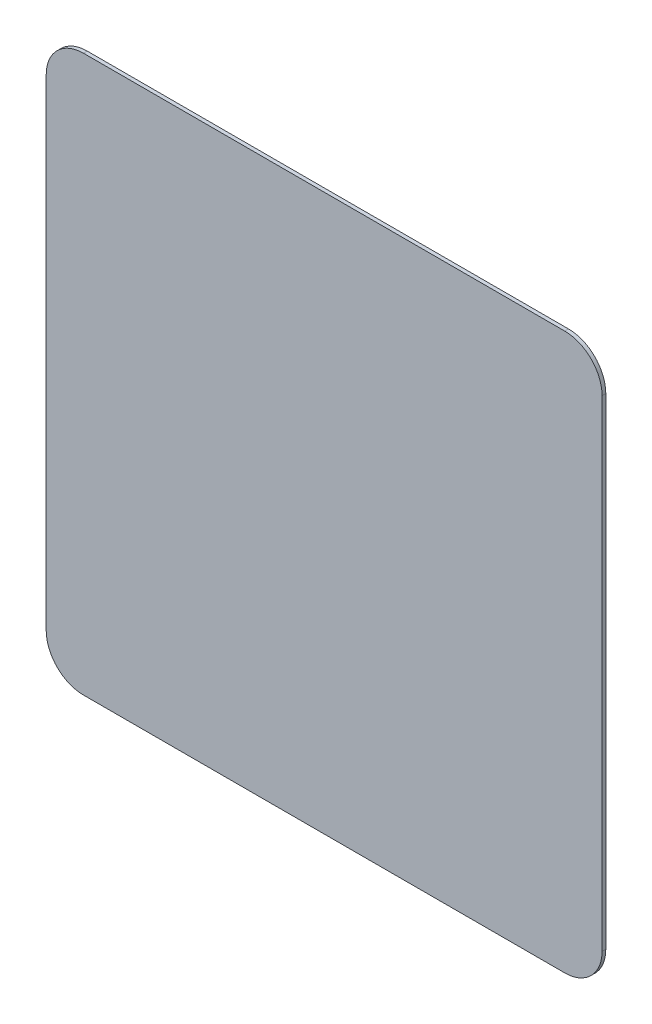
ISO-10303-21;
HEADER;
FILE_DESCRIPTION(('STEP AP214'),'2;1');
FILE_NAME('part.step','',(''),(''),'','','');
FILE_SCHEMA(('AUTOMOTIVE_DESIGN { 1 0 10303 214 1 1 1 1 }'));
ENDSEC;
DATA;
#1=APPLICATION_CONTEXT('core data for automotive mechanical design processes');
#2=APPLICATION_PROTOCOL_DEFINITION('international standard','automotive_design',2000,#1);
#3=PRODUCT_CONTEXT('',#1,'mechanical');
#4=PRODUCT('Part','Part','',(#3));
#5=PRODUCT_RELATED_PRODUCT_CATEGORY('part','',(#4));
#6=PRODUCT_DEFINITION_FORMATION('','',#4);
#7=PRODUCT_DEFINITION_CONTEXT('part definition',#1,'design');
#8=PRODUCT_DEFINITION('design','',#6,#7);
#9=PRODUCT_DEFINITION_SHAPE('','',#8);
#10=(LENGTH_UNIT() NAMED_UNIT(*) SI_UNIT(.MILLI.,.METRE.));
#11=(NAMED_UNIT(*) PLANE_ANGLE_UNIT() SI_UNIT($,.RADIAN.));
#12=(NAMED_UNIT(*) SI_UNIT($,.STERADIAN.) SOLID_ANGLE_UNIT());
#13=UNCERTAINTY_MEASURE_WITH_UNIT(LENGTH_MEASURE(1.E-05),#10,'distance_accuracy_value','');
#14=(GEOMETRIC_REPRESENTATION_CONTEXT(3) GLOBAL_UNCERTAINTY_ASSIGNED_CONTEXT((#13)) GLOBAL_UNIT_ASSIGNED_CONTEXT((#10,
#11,#12)) REPRESENTATION_CONTEXT('',''));
#15=CARTESIAN_POINT('',(0.,0.,0.));
#16=DIRECTION('',(0.,0.,1.));
#17=DIRECTION('',(1.,0.,0.));
#18=AXIS2_PLACEMENT_3D('',#15,#16,#17);
#19=CARTESIAN_POINT('',(-32.9325153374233,15.3061349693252,0.4));
#20=DIRECTION('',(0.,0.,-1.));
#21=DIRECTION('',(-1.,0.,0.));
#22=AXIS2_PLACEMENT_3D('',#19,#20,#21);
#23=CYLINDRICAL_SURFACE('',#22,4.);
#24=CARTESIAN_POINT('',(-32.9325153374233,15.3061349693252,0.));
#25=DIRECTION('',(0.,0.,1.));
#26=DIRECTION('',(-1.,0.,0.));
#27=AXIS2_PLACEMENT_3D('',#24,#25,#26);
#28=CIRCLE('',#27,4.);
#29=CARTESIAN_POINT('',(-32.9325153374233,19.3061349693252,0.));
#30=VERTEX_POINT('',#29);
#31=CARTESIAN_POINT('',(-36.9325153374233,15.3061349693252,0.));
#32=VERTEX_POINT('',#31);
#33=EDGE_CURVE('E131',#30,#32,#28,.T.);
#34=ORIENTED_EDGE('',*,*,#33,.T.);
#35=DIRECTION('',(0.,0.,-1.));
#36=VECTOR('',#35,1.);
#37=CARTESIAN_POINT('',(-36.9325153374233,15.3061349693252,0.4));
#38=LINE('',#37,#36);
#39=CARTESIAN_POINT('',(-36.9325153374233,15.3061349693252,0.4));
#40=VERTEX_POINT('',#39);
#41=EDGE_CURVE('E11',#40,#32,#38,.T.);
#42=ORIENTED_EDGE('',*,*,#41,.F.);
#43=CARTESIAN_POINT('',(-32.9325153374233,15.3061349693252,0.4));
#44=DIRECTION('',(0.,0.,1.));
#45=DIRECTION('',(-1.,0.,0.));
#46=AXIS2_PLACEMENT_3D('',#43,#44,#45);
#47=CIRCLE('',#46,4.);
#48=CARTESIAN_POINT('',(-32.9325153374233,19.3061349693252,0.4));
#49=VERTEX_POINT('',#48);
#50=EDGE_CURVE('E145',#49,#40,#47,.T.);
#51=ORIENTED_EDGE('',*,*,#50,.F.);
#52=DIRECTION('',(0.,0.,-1.));
#53=VECTOR('',#52,1.);
#54=CARTESIAN_POINT('',(-32.9325153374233,19.3061349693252,0.4));
#55=LINE('',#54,#53);
#56=EDGE_CURVE('E127',#49,#30,#55,.T.);
#57=ORIENTED_EDGE('',*,*,#56,.T.);
#58=EDGE_LOOP('',(#34,#42,#51,#57));
#59=FACE_BOUND('',#58,.T.);
#60=ADVANCED_FACE('F35',(#59),#23,.T.);
#61=CARTESIAN_POINT('',(-36.9325153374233,15.3061349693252,0.4));
#62=DIRECTION('',(1.,0.,0.));
#63=DIRECTION('',(0.,1.,0.));
#64=AXIS2_PLACEMENT_3D('',#61,#62,#63);
#65=PLANE('',#64);
#66=DIRECTION('',(0.,-1.,0.));
#67=VECTOR('',#66,1.);
#68=CARTESIAN_POINT('',(-36.9325153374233,15.3061349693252,0.));
#69=LINE('',#68,#67);
#70=CARTESIAN_POINT('',(-36.9325153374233,-36.2938650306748,0.));
#71=VERTEX_POINT('',#70);
#72=EDGE_CURVE('E134',#32,#71,#69,.T.);
#73=ORIENTED_EDGE('',*,*,#72,.T.);
#74=DIRECTION('',(0.,0.,-1.));
#75=VECTOR('',#74,1.);
#76=CARTESIAN_POINT('',(-36.9325153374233,-36.2938650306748,0.4));
#77=LINE('',#76,#75);
#78=CARTESIAN_POINT('',(-36.9325153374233,-36.2938650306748,0.4));
#79=VERTEX_POINT('',#78);
#80=EDGE_CURVE('E43',#79,#71,#77,.T.);
#81=ORIENTED_EDGE('',*,*,#80,.F.);
#82=DIRECTION('',(0.,-1.,0.));
#83=VECTOR('',#82,1.);
#84=CARTESIAN_POINT('',(-36.9325153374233,15.3061349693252,0.4));
#85=LINE('',#84,#83);
#86=EDGE_CURVE('E94',#40,#79,#85,.T.);
#87=ORIENTED_EDGE('',*,*,#86,.F.);
#88=ORIENTED_EDGE('',*,*,#41,.T.);
#89=EDGE_LOOP('',(#73,#81,#87,#88));
#90=FACE_BOUND('',#89,.T.);
#91=ADVANCED_FACE('F180',(#90),#65,.F.);
#92=CARTESIAN_POINT('',(-32.9325153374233,-36.2938650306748,0.4));
#93=DIRECTION('',(0.,0.,-1.));
#94=DIRECTION('',(-1.,0.,0.));
#95=AXIS2_PLACEMENT_3D('',#92,#93,#94);
#96=CYLINDRICAL_SURFACE('',#95,4.);
#97=CARTESIAN_POINT('',(-32.9325153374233,-36.2938650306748,0.));
#98=DIRECTION('',(0.,0.,1.));
#99=DIRECTION('',(1.,0.,0.));
#100=AXIS2_PLACEMENT_3D('',#97,#98,#99);
#101=CIRCLE('',#100,4.);
#102=CARTESIAN_POINT('',(-32.9325153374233,-40.2938650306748,0.));
#103=VERTEX_POINT('',#102);
#104=EDGE_CURVE('E136',#71,#103,#101,.T.);
#105=ORIENTED_EDGE('',*,*,#104,.T.);
#106=DIRECTION('',(0.,0.,-1.));
#107=VECTOR('',#106,1.);
#108=CARTESIAN_POINT('',(-32.9325153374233,-40.2938650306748,0.4));
#109=LINE('',#108,#107);
#110=CARTESIAN_POINT('',(-32.9325153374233,-40.2938650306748,0.4));
#111=VERTEX_POINT('',#110);
#112=EDGE_CURVE('E152',#111,#103,#109,.T.);
#113=ORIENTED_EDGE('',*,*,#112,.F.);
#114=CARTESIAN_POINT('',(-32.9325153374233,-36.2938650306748,0.4));
#115=DIRECTION('',(0.,0.,1.));
#116=DIRECTION('',(1.,0.,0.));
#117=AXIS2_PLACEMENT_3D('',#114,#115,#116);
#118=CIRCLE('',#117,4.);
#119=EDGE_CURVE('E160',#79,#111,#118,.T.);
#120=ORIENTED_EDGE('',*,*,#119,.F.);
#121=ORIENTED_EDGE('',*,*,#80,.T.);
#122=EDGE_LOOP('',(#105,#113,#120,#121));
#123=FACE_BOUND('',#122,.T.);
#124=ADVANCED_FACE('F158',(#123),#96,.T.);
#125=CARTESIAN_POINT('',(-32.9325153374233,-40.2938650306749,0.4));
#126=DIRECTION('',(0.,1.,0.));
#127=DIRECTION('',(0.,0.,1.));
#128=AXIS2_PLACEMENT_3D('',#125,#126,#127);
#129=PLANE('',#128);
#130=DIRECTION('',(1.,0.,0.));
#131=VECTOR('',#130,1.);
#132=CARTESIAN_POINT('',(-32.9325153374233,-40.2938650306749,0.));
#133=LINE('',#132,#131);
#134=CARTESIAN_POINT('',(18.6674846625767,-40.2938650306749,0.));
#135=VERTEX_POINT('',#134);
#136=EDGE_CURVE('E138',#103,#135,#133,.T.);
#137=ORIENTED_EDGE('',*,*,#136,.T.);
#138=DIRECTION('',(0.,0.,-1.));
#139=VECTOR('',#138,1.);
#140=CARTESIAN_POINT('',(18.6674846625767,-40.2938650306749,0.4));
#141=LINE('',#140,#139);
#142=CARTESIAN_POINT('',(18.6674846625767,-40.2938650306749,0.4));
#143=VERTEX_POINT('',#142);
#144=EDGE_CURVE('E149',#143,#135,#141,.T.);
#145=ORIENTED_EDGE('',*,*,#144,.F.);
#146=DIRECTION('',(1.,0.,0.));
#147=VECTOR('',#146,1.);
#148=CARTESIAN_POINT('',(-32.9325153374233,-40.2938650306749,0.4));
#149=LINE('',#148,#147);
#150=EDGE_CURVE('E172',#111,#143,#149,.T.);
#151=ORIENTED_EDGE('',*,*,#150,.F.);
#152=ORIENTED_EDGE('',*,*,#112,.T.);
#153=EDGE_LOOP('',(#137,#145,#151,#152));
#154=FACE_BOUND('',#153,.T.);
#155=ADVANCED_FACE('F168',(#154),#129,.F.);
#156=CARTESIAN_POINT('',(18.6674846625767,-36.2938650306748,0.4));
#157=DIRECTION('',(0.,0.,-1.));
#158=DIRECTION('',(-1.,0.,0.));
#159=AXIS2_PLACEMENT_3D('',#156,#157,#158);
#160=CYLINDRICAL_SURFACE('',#159,4.);
#161=CARTESIAN_POINT('',(18.6674846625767,-36.2938650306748,0.));
#162=DIRECTION('',(0.,0.,1.));
#163=DIRECTION('',(1.,0.,0.));
#164=AXIS2_PLACEMENT_3D('',#161,#162,#163);
#165=CIRCLE('',#164,4.);
#166=CARTESIAN_POINT('',(22.6674846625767,-36.2938650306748,0.));
#167=VERTEX_POINT('',#166);
#168=EDGE_CURVE('E140',#135,#167,#165,.T.);
#169=ORIENTED_EDGE('',*,*,#168,.T.);
#170=DIRECTION('',(0.,0.,-1.));
#171=VECTOR('',#170,1.);
#172=CARTESIAN_POINT('',(22.6674846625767,-36.2938650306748,0.4));
#173=LINE('',#172,#171);
#174=CARTESIAN_POINT('',(22.6674846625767,-36.2938650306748,0.4));
#175=VERTEX_POINT('',#174);
#176=EDGE_CURVE('E122',#175,#167,#173,.T.);
#177=ORIENTED_EDGE('',*,*,#176,.F.);
#178=CARTESIAN_POINT('',(18.6674846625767,-36.2938650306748,0.4));
#179=DIRECTION('',(0.,0.,1.));
#180=DIRECTION('',(1.,0.,0.));
#181=AXIS2_PLACEMENT_3D('',#178,#179,#180);
#182=CIRCLE('',#181,4.);
#183=EDGE_CURVE('E113',#143,#175,#182,.T.);
#184=ORIENTED_EDGE('',*,*,#183,.F.);
#185=ORIENTED_EDGE('',*,*,#144,.T.);
#186=EDGE_LOOP('',(#169,#177,#184,#185));
#187=FACE_BOUND('',#186,.T.);
#188=ADVANCED_FACE('F171',(#187),#160,.T.);
#189=CARTESIAN_POINT('',(22.6674846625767,15.3061349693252,0.4));
#190=DIRECTION('',(-1.,0.,0.));
#191=DIRECTION('',(0.,-1.,0.));
#192=AXIS2_PLACEMENT_3D('',#189,#190,#191);
#193=PLANE('',#192);
#194=DIRECTION('',(0.,1.,0.));
#195=VECTOR('',#194,1.);
#196=CARTESIAN_POINT('',(22.6674846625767,15.3061349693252,0.));
#197=LINE('',#196,#195);
#198=CARTESIAN_POINT('',(22.6674846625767,15.3061349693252,0.));
#199=VERTEX_POINT('',#198);
#200=EDGE_CURVE('E121',#167,#199,#197,.T.);
#201=ORIENTED_EDGE('',*,*,#200,.T.);
#202=DIRECTION('',(0.,0.,-1.));
#203=VECTOR('',#202,1.);
#204=CARTESIAN_POINT('',(22.6674846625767,15.3061349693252,0.4));
#205=LINE('',#204,#203);
#206=CARTESIAN_POINT('',(22.6674846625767,15.3061349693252,0.4));
#207=VERTEX_POINT('',#206);
#208=EDGE_CURVE('E118',#207,#199,#205,.T.);
#209=ORIENTED_EDGE('',*,*,#208,.F.);
#210=DIRECTION('',(0.,1.,0.));
#211=VECTOR('',#210,1.);
#212=CARTESIAN_POINT('',(22.6674846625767,15.3061349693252,0.4));
#213=LINE('',#212,#211);
#214=EDGE_CURVE('E107',#175,#207,#213,.T.);
#215=ORIENTED_EDGE('',*,*,#214,.F.);
#216=ORIENTED_EDGE('',*,*,#176,.T.);
#217=EDGE_LOOP('',(#201,#209,#215,#216));
#218=FACE_BOUND('',#217,.T.);
#219=ADVANCED_FACE('F119',(#218),#193,.F.);
#220=CARTESIAN_POINT('',(18.6674846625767,15.3061349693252,0.4));
#221=DIRECTION('',(0.,0.,-1.));
#222=DIRECTION('',(-1.,0.,0.));
#223=AXIS2_PLACEMENT_3D('',#220,#221,#222);
#224=CYLINDRICAL_SURFACE('',#223,4.);
#225=CARTESIAN_POINT('',(18.6674846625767,15.3061349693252,0.));
#226=DIRECTION('',(0.,0.,1.));
#227=DIRECTION('',(-1.,0.,0.));
#228=AXIS2_PLACEMENT_3D('',#225,#226,#227);
#229=CIRCLE('',#228,4.);
#230=CARTESIAN_POINT('',(18.6674846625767,19.3061349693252,0.));
#231=VERTEX_POINT('',#230);
#232=EDGE_CURVE('E80',#199,#231,#229,.T.);
#233=ORIENTED_EDGE('',*,*,#232,.T.);
#234=DIRECTION('',(0.,0.,-1.));
#235=VECTOR('',#234,1.);
#236=CARTESIAN_POINT('',(18.6674846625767,19.3061349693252,0.4));
#237=LINE('',#236,#235);
#238=CARTESIAN_POINT('',(18.6674846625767,19.3061349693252,0.4));
#239=VERTEX_POINT('',#238);
#240=EDGE_CURVE('E123',#239,#231,#237,.T.);
#241=ORIENTED_EDGE('',*,*,#240,.F.);
#242=CARTESIAN_POINT('',(18.6674846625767,15.3061349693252,0.4));
#243=DIRECTION('',(0.,0.,1.));
#244=DIRECTION('',(-1.,0.,0.));
#245=AXIS2_PLACEMENT_3D('',#242,#243,#244);
#246=CIRCLE('',#245,4.);
#247=EDGE_CURVE('E111',#207,#239,#246,.T.);
#248=ORIENTED_EDGE('',*,*,#247,.F.);
#249=ORIENTED_EDGE('',*,*,#208,.T.);
#250=EDGE_LOOP('',(#233,#241,#248,#249));
#251=FACE_BOUND('',#250,.T.);
#252=ADVANCED_FACE('F125',(#251),#224,.T.);
#253=CARTESIAN_POINT('',(-32.9325153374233,19.3061349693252,0.4));
#254=DIRECTION('',(0.,-1.,0.));
#255=DIRECTION('',(0.,0.,-1.));
#256=AXIS2_PLACEMENT_3D('',#253,#254,#255);
#257=PLANE('',#256);
#258=DIRECTION('',(-1.,0.,0.));
#259=VECTOR('',#258,1.);
#260=CARTESIAN_POINT('',(-32.9325153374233,19.3061349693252,0.));
#261=LINE('',#260,#259);
#262=EDGE_CURVE('E86',#231,#30,#261,.T.);
#263=ORIENTED_EDGE('',*,*,#262,.T.);
#264=ORIENTED_EDGE('',*,*,#56,.F.);
#265=DIRECTION('',(-1.,0.,0.));
#266=VECTOR('',#265,1.);
#267=CARTESIAN_POINT('',(-32.9325153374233,19.3061349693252,0.4));
#268=LINE('',#267,#266);
#269=EDGE_CURVE('E51',#239,#49,#268,.T.);
#270=ORIENTED_EDGE('',*,*,#269,.F.);
#271=ORIENTED_EDGE('',*,*,#240,.T.);
#272=EDGE_LOOP('',(#263,#264,#270,#271));
#273=FACE_BOUND('',#272,.T.);
#274=ADVANCED_FACE('F196',(#273),#257,.F.);
#275=CARTESIAN_POINT('',(-32.9325153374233,15.3061349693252,0.4));
#276=DIRECTION('',(0.,0.,-1.));
#277=DIRECTION('',(-1.,0.,0.));
#278=AXIS2_PLACEMENT_3D('',#275,#276,#277);
#279=PLANE('',#278);
#280=ORIENTED_EDGE('',*,*,#50,.T.);
#281=ORIENTED_EDGE('',*,*,#86,.T.);
#282=ORIENTED_EDGE('',*,*,#119,.T.);
#283=ORIENTED_EDGE('',*,*,#150,.T.);
#284=ORIENTED_EDGE('',*,*,#183,.T.);
#285=ORIENTED_EDGE('',*,*,#214,.T.);
#286=ORIENTED_EDGE('',*,*,#247,.T.);
#287=ORIENTED_EDGE('',*,*,#269,.T.);
#288=EDGE_LOOP('',(#280,#281,#282,#283,#284,#285,#286,#287));
#289=FACE_BOUND('',#288,.T.);
#290=ADVANCED_FACE('F109',(#289),#279,.F.);
#291=CARTESIAN_POINT('',(-32.9325153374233,15.3061349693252,0.));
#292=DIRECTION('',(0.,0.,-1.));
#293=DIRECTION('',(-1.,0.,0.));
#294=AXIS2_PLACEMENT_3D('',#291,#292,#293);
#295=PLANE('',#294);
#296=ORIENTED_EDGE('',*,*,#33,.F.);
#297=ORIENTED_EDGE('',*,*,#262,.F.);
#298=ORIENTED_EDGE('',*,*,#232,.F.);
#299=ORIENTED_EDGE('',*,*,#200,.F.);
#300=ORIENTED_EDGE('',*,*,#168,.F.);
#301=ORIENTED_EDGE('',*,*,#136,.F.);
#302=ORIENTED_EDGE('',*,*,#104,.F.);
#303=ORIENTED_EDGE('',*,*,#72,.F.);
#304=EDGE_LOOP('',(#296,#297,#298,#299,#300,#301,#302,#303));
#305=FACE_BOUND('',#304,.T.);
#306=ADVANCED_FACE('F164',(#305),#295,.T.);
#307=CLOSED_SHELL('',(#60,#91,#124,#155,#188,#219,#252,#274,#290,#306));
#308=MANIFOLD_SOLID_BREP('B2',#307);
#309=ADVANCED_BREP_SHAPE_REPRESENTATION('',(#18,#308),#14);
#310=SHAPE_DEFINITION_REPRESENTATION(#9,#309);
ENDSEC;
END-ISO-10303-21;
